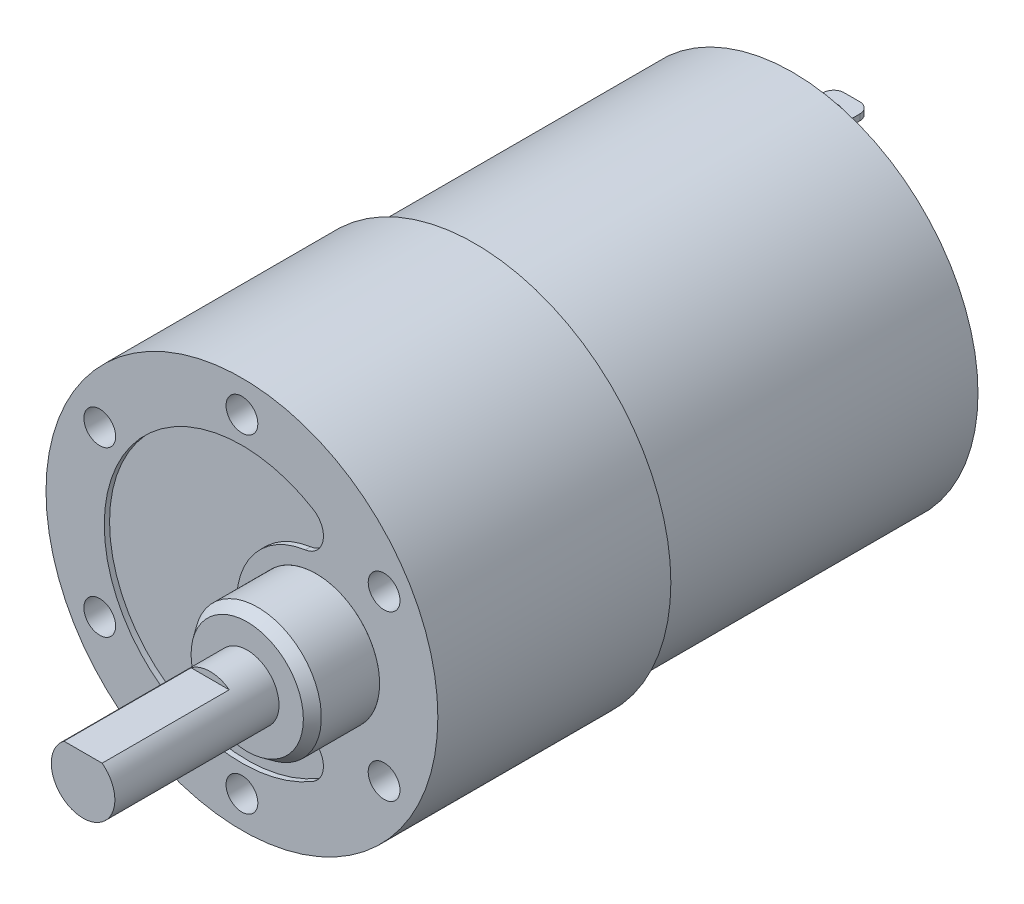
ISO-10303-21;
HEADER;
FILE_DESCRIPTION(('STEP AP214'),'2;1');
FILE_NAME('part.step','',(''),(''),'','','');
FILE_SCHEMA(('AUTOMOTIVE_DESIGN { 1 0 10303 214 1 1 1 1 }'));
ENDSEC;
DATA;
#1=APPLICATION_CONTEXT('core data for automotive mechanical design processes');
#2=APPLICATION_PROTOCOL_DEFINITION('international standard','automotive_design',2000,#1);
#3=PRODUCT_CONTEXT('',#1,'mechanical');
#4=PRODUCT('Part','Part','',(#3));
#5=PRODUCT_RELATED_PRODUCT_CATEGORY('part','',(#4));
#6=PRODUCT_DEFINITION_FORMATION('','',#4);
#7=PRODUCT_DEFINITION_CONTEXT('part definition',#1,'design');
#8=PRODUCT_DEFINITION('design','',#6,#7);
#9=PRODUCT_DEFINITION_SHAPE('','',#8);
#10=(LENGTH_UNIT() NAMED_UNIT(*) SI_UNIT(.MILLI.,.METRE.));
#11=(NAMED_UNIT(*) PLANE_ANGLE_UNIT() SI_UNIT($,.RADIAN.));
#12=(NAMED_UNIT(*) SI_UNIT($,.STERADIAN.) SOLID_ANGLE_UNIT());
#13=UNCERTAINTY_MEASURE_WITH_UNIT(LENGTH_MEASURE(1.E-05),#10,'distance_accuracy_value','');
#14=(GEOMETRIC_REPRESENTATION_CONTEXT(3) GLOBAL_UNCERTAINTY_ASSIGNED_CONTEXT((#13)) GLOBAL_UNIT_ASSIGNED_CONTEXT((#10,
#11,#12)) REPRESENTATION_CONTEXT('',''));
#15=CARTESIAN_POINT('',(0.,0.,0.));
#16=DIRECTION('',(0.,0.,1.));
#17=DIRECTION('',(1.,0.,0.));
#18=AXIS2_PLACEMENT_3D('',#15,#16,#17);
#19=CARTESIAN_POINT('',(0.,0.,0.));
#20=DIRECTION('',(0.,0.,1.));
#21=DIRECTION('',(1.,0.,0.));
#22=AXIS2_PLACEMENT_3D('',#19,#20,#21);
#23=PLANE('',#22);
#24=CARTESIAN_POINT('',(5.69642857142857,-9.41013823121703,0.));
#25=DIRECTION('',(0.,0.,1.));
#26=DIRECTION('',(-1.,0.,0.));
#27=AXIS2_PLACEMENT_3D('',#24,#25,#26);
#28=CIRCLE('',#27,2.);
#29=CARTESIAN_POINT('',(6.73214285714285,-11.1210724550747,0.));
#30=VERTEX_POINT('',#29);
#31=CARTESIAN_POINT('',(5.97086466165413,-7.42905649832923,0.));
#32=VERTEX_POINT('',#31);
#33=EDGE_CURVE('E151',#30,#32,#28,.T.);
#34=ORIENTED_EDGE('',*,*,#33,.F.);
#35=CARTESIAN_POINT('',(0.,0.,0.));
#36=DIRECTION('',(0.,0.,1.));
#37=DIRECTION('',(1.,0.,0.));
#38=AXIS2_PLACEMENT_3D('',#35,#36,#37);
#39=CIRCLE('',#38,13.);
#40=CARTESIAN_POINT('',(6.73214285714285,11.1210724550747,0.));
#41=VERTEX_POINT('',#40);
#42=EDGE_CURVE('E184',#41,#30,#39,.T.);
#43=ORIENTED_EDGE('',*,*,#42,.F.);
#44=CARTESIAN_POINT('',(5.69642857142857,9.41013823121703,0.));
#45=DIRECTION('',(0.,0.,1.));
#46=DIRECTION('',(1.,0.,0.));
#47=AXIS2_PLACEMENT_3D('',#44,#45,#46);
#48=CIRCLE('',#47,2.);
#49=CARTESIAN_POINT('',(5.97086466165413,7.42905649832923,0.));
#50=VERTEX_POINT('',#49);
#51=EDGE_CURVE('E180',#50,#41,#48,.T.);
#52=ORIENTED_EDGE('',*,*,#51,.F.);
#53=CARTESIAN_POINT('',(7.,0.,0.));
#54=DIRECTION('',(0.,0.,-1.));
#55=DIRECTION('',(1.,0.,0.));
#56=AXIS2_PLACEMENT_3D('',#53,#54,#55);
#57=CIRCLE('',#56,7.5);
#58=EDGE_CURVE('E160',#32,#50,#57,.T.);
#59=ORIENTED_EDGE('',*,*,#58,.F.);
#60=EDGE_LOOP('',(#34,#43,#52,#59));
#61=FACE_BOUND('',#60,.T.);
#62=CARTESIAN_POINT('',(0.,0.,0.));
#63=DIRECTION('',(0.,0.,1.));
#64=DIRECTION('',(1.,0.,0.));
#65=AXIS2_PLACEMENT_3D('',#62,#63,#64);
#66=CIRCLE('',#65,18.5);
#67=CARTESIAN_POINT('',(18.5,0.,0.));
#68=VERTEX_POINT('',#67);
#69=EDGE_CURVE('E238',#68,#68,#66,.T.);
#70=ORIENTED_EDGE('',*,*,#69,.T.);
#71=EDGE_LOOP('',(#70));
#72=FACE_BOUND('',#71,.T.);
#73=CARTESIAN_POINT('',(0.,15.5,0.));
#74=DIRECTION('',(0.,0.,1.));
#75=DIRECTION('',(1.,0.,0.));
#76=AXIS2_PLACEMENT_3D('',#73,#74,#75);
#77=CIRCLE('',#76,1.5);
#78=CARTESIAN_POINT('',(1.5,15.5,0.));
#79=VERTEX_POINT('',#78);
#80=EDGE_CURVE('E222',#79,#79,#77,.T.);
#81=ORIENTED_EDGE('',*,*,#80,.F.);
#82=EDGE_LOOP('',(#81));
#83=FACE_BOUND('',#82,.T.);
#84=CARTESIAN_POINT('',(-13.4233937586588,7.74999999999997,0.));
#85=DIRECTION('',(0.,0.,1.));
#86=DIRECTION('',(0.499999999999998,0.86602540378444,0.));
#87=AXIS2_PLACEMENT_3D('',#84,#85,#86);
#88=CIRCLE('',#87,1.5);
#89=CARTESIAN_POINT('',(-12.6733937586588,9.04903810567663,0.));
#90=VERTEX_POINT('',#89);
#91=EDGE_CURVE('E216',#90,#90,#88,.T.);
#92=ORIENTED_EDGE('',*,*,#91,.F.);
#93=EDGE_LOOP('',(#92));
#94=FACE_BOUND('',#93,.T.);
#95=CARTESIAN_POINT('',(-13.4233937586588,-7.75000000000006,0.));
#96=DIRECTION('',(0.,0.,1.));
#97=DIRECTION('',(-0.500000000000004,0.866025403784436,0.));
#98=AXIS2_PLACEMENT_3D('',#95,#96,#97);
#99=CIRCLE('',#98,1.5);
#100=CARTESIAN_POINT('',(-14.1733937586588,-6.45096189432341,0.));
#101=VERTEX_POINT('',#100);
#102=EDGE_CURVE('E210',#101,#101,#99,.T.);
#103=ORIENTED_EDGE('',*,*,#102,.F.);
#104=EDGE_LOOP('',(#103));
#105=FACE_BOUND('',#104,.T.);
#106=CARTESIAN_POINT('',(0.,-15.5,0.));
#107=DIRECTION('',(0.,0.,1.));
#108=DIRECTION('',(-1.,0.,0.));
#109=AXIS2_PLACEMENT_3D('',#106,#107,#108);
#110=CIRCLE('',#109,1.5);
#111=CARTESIAN_POINT('',(-1.5,-15.5,0.));
#112=VERTEX_POINT('',#111);
#113=EDGE_CURVE('E204',#112,#112,#110,.T.);
#114=ORIENTED_EDGE('',*,*,#113,.F.);
#115=EDGE_LOOP('',(#114));
#116=FACE_BOUND('',#115,.T.);
#117=CARTESIAN_POINT('',(13.4233937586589,-7.74999999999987,0.));
#118=DIRECTION('',(0.,0.,1.));
#119=DIRECTION('',(-0.499999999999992,-0.866025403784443,0.));
#120=AXIS2_PLACEMENT_3D('',#117,#118,#119);
#121=CIRCLE('',#120,1.5);
#122=CARTESIAN_POINT('',(12.6733937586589,-9.04903810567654,0.));
#123=VERTEX_POINT('',#122);
#124=EDGE_CURVE('E198',#123,#123,#121,.T.);
#125=ORIENTED_EDGE('',*,*,#124,.F.);
#126=EDGE_LOOP('',(#125));
#127=FACE_BOUND('',#126,.T.);
#128=CARTESIAN_POINT('',(13.4233937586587,7.75000000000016,0.));
#129=DIRECTION('',(0.,0.,1.));
#130=DIRECTION('',(0.50000000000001,-0.866025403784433,0.));
#131=AXIS2_PLACEMENT_3D('',#128,#129,#130);
#132=CIRCLE('',#131,1.5);
#133=CARTESIAN_POINT('',(14.1733937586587,6.45096189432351,0.));
#134=VERTEX_POINT('',#133);
#135=EDGE_CURVE('E192',#134,#134,#132,.T.);
#136=ORIENTED_EDGE('',*,*,#135,.F.);
#137=EDGE_LOOP('',(#136));
#138=FACE_BOUND('',#137,.T.);
#139=CARTESIAN_POINT('',(7.,0.,0.));
#140=DIRECTION('',(0.,0.,1.));
#141=DIRECTION('',(1.,0.,0.));
#142=AXIS2_PLACEMENT_3D('',#139,#140,#141);
#143=CIRCLE('',#142,6.);
#144=CARTESIAN_POINT('',(13.,0.,0.));
#145=VERTEX_POINT('',#144);
#146=EDGE_CURVE('E46',#145,#145,#143,.T.);
#147=ORIENTED_EDGE('',*,*,#146,.F.);
#148=EDGE_LOOP('',(#147));
#149=FACE_BOUND('',#148,.T.);
#150=ADVANCED_FACE('F42',(#61,#72,#83,#94,#105,#116,#127,#138,#149),#23,.T.);
#151=CARTESIAN_POINT('',(1.73676249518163,-12.0859636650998,-57.6));
#152=DIRECTION('',(0.,1.,0.));
#153=DIRECTION('',(0.,0.,1.));
#154=AXIS2_PLACEMENT_3D('',#151,#152,#153);
#155=PLANE('',#154);
#156=DIRECTION('',(-1.,0.,0.));
#157=VECTOR('',#156,1.);
#158=CARTESIAN_POINT('',(1.73676249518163,-12.0859636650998,-57.6));
#159=LINE('',#158,#157);
#160=CARTESIAN_POINT('',(0.736762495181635,-12.0859636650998,-57.6));
#161=VERTEX_POINT('',#160);
#162=CARTESIAN_POINT('',(-0.736762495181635,-12.0859636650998,-57.6));
#163=VERTEX_POINT('',#162);
#164=EDGE_CURVE('E234',#161,#163,#159,.T.);
#165=ORIENTED_EDGE('',*,*,#164,.T.);
#166=CARTESIAN_POINT('',(-0.736762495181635,-12.0859636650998,-56.6));
#167=DIRECTION('',(0.,1.,0.));
#168=DIRECTION('',(0.,0.,1.));
#169=AXIS2_PLACEMENT_3D('',#166,#167,#168);
#170=CIRCLE('',#169,1.);
#171=CARTESIAN_POINT('',(-1.73676249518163,-12.0859636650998,-56.6));
#172=VERTEX_POINT('',#171);
#173=EDGE_CURVE('E237',#163,#172,#170,.T.);
#174=ORIENTED_EDGE('',*,*,#173,.T.);
#175=DIRECTION('',(0.,0.,1.));
#176=VECTOR('',#175,1.);
#177=CARTESIAN_POINT('',(-1.73676249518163,-12.0859636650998,-57.6));
#178=LINE('',#177,#176);
#179=CARTESIAN_POINT('',(-1.73676249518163,-12.0859636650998,-52.));
#180=VERTEX_POINT('',#179);
#181=EDGE_CURVE('E264',#172,#180,#178,.T.);
#182=ORIENTED_EDGE('',*,*,#181,.T.);
#183=DIRECTION('',(-1.,0.,0.));
#184=VECTOR('',#183,1.);
#185=CARTESIAN_POINT('',(1.73676249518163,-12.0859636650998,-52.));
#186=LINE('',#185,#184);
#187=CARTESIAN_POINT('',(1.73676249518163,-12.0859636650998,-52.));
#188=VERTEX_POINT('',#187);
#189=EDGE_CURVE('E247',#188,#180,#186,.T.);
#190=ORIENTED_EDGE('',*,*,#189,.F.);
#191=DIRECTION('',(0.,0.,1.));
#192=VECTOR('',#191,1.);
#193=CARTESIAN_POINT('',(1.73676249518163,-12.0859636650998,-57.6));
#194=LINE('',#193,#192);
#195=CARTESIAN_POINT('',(1.73676249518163,-12.0859636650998,-56.6));
#196=VERTEX_POINT('',#195);
#197=EDGE_CURVE('E261',#196,#188,#194,.T.);
#198=ORIENTED_EDGE('',*,*,#197,.F.);
#199=CARTESIAN_POINT('',(0.736762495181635,-12.0859636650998,-56.6));
#200=DIRECTION('',(0.,1.,0.));
#201=DIRECTION('',(0.,0.,1.));
#202=AXIS2_PLACEMENT_3D('',#199,#200,#201);
#203=CIRCLE('',#202,1.);
#204=EDGE_CURVE('E266',#196,#161,#203,.T.);
#205=ORIENTED_EDGE('',*,*,#204,.T.);
#206=EDGE_LOOP('',(#165,#174,#182,#190,#198,#205));
#207=FACE_BOUND('',#206,.T.);
#208=CARTESIAN_POINT('',(0.,-12.0859636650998,-55.7146202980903));
#209=DIRECTION('',(0.,1.,0.));
#210=DIRECTION('',(0.,0.,1.));
#211=AXIS2_PLACEMENT_3D('',#208,#209,#210);
#212=CIRCLE('',#211,0.618667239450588);
#213=CARTESIAN_POINT('',(0.,-12.0859636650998,-55.0959530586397));
#214=VERTEX_POINT('',#213);
#215=EDGE_CURVE('E225',#214,#214,#212,.T.);
#216=ORIENTED_EDGE('',*,*,#215,.F.);
#217=EDGE_LOOP('',(#216));
#218=FACE_BOUND('',#217,.T.);
#219=ADVANCED_FACE('F352',(#207,#218),#155,.T.);
#220=CARTESIAN_POINT('',(1.73676249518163,-12.6569540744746,-57.6));
#221=DIRECTION('',(0.,-1.,0.));
#222=DIRECTION('',(0.,0.,-1.));
#223=AXIS2_PLACEMENT_3D('',#220,#221,#222);
#224=PLANE('',#223);
#225=DIRECTION('',(0.,0.,1.));
#226=VECTOR('',#225,1.);
#227=CARTESIAN_POINT('',(-1.73676249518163,-12.6569540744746,-57.6));
#228=LINE('',#227,#226);
#229=CARTESIAN_POINT('',(-1.73676249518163,-12.6569540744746,-56.6));
#230=VERTEX_POINT('',#229);
#231=CARTESIAN_POINT('',(-1.73676249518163,-12.6569540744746,-52.));
#232=VERTEX_POINT('',#231);
#233=EDGE_CURVE('E256',#230,#232,#228,.T.);
#234=ORIENTED_EDGE('',*,*,#233,.F.);
#235=CARTESIAN_POINT('',(-0.736762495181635,-12.6569540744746,-56.6));
#236=DIRECTION('',(0.,-1.,0.));
#237=DIRECTION('',(0.,0.,-1.));
#238=AXIS2_PLACEMENT_3D('',#235,#236,#237);
#239=CIRCLE('',#238,1.);
#240=CARTESIAN_POINT('',(-0.736762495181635,-12.6569540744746,-57.6));
#241=VERTEX_POINT('',#240);
#242=EDGE_CURVE('E243',#230,#241,#239,.T.);
#243=ORIENTED_EDGE('',*,*,#242,.T.);
#244=DIRECTION('',(1.,0.,0.));
#245=VECTOR('',#244,1.);
#246=CARTESIAN_POINT('',(1.73676249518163,-12.6569540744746,-57.6));
#247=LINE('',#246,#245);
#248=CARTESIAN_POINT('',(0.736762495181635,-12.6569540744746,-57.6));
#249=VERTEX_POINT('',#248);
#250=EDGE_CURVE('E239',#241,#249,#247,.T.);
#251=ORIENTED_EDGE('',*,*,#250,.T.);
#252=CARTESIAN_POINT('',(0.736762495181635,-12.6569540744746,-56.6));
#253=DIRECTION('',(0.,-1.,0.));
#254=DIRECTION('',(0.,0.,-1.));
#255=AXIS2_PLACEMENT_3D('',#252,#253,#254);
#256=CIRCLE('',#255,1.);
#257=CARTESIAN_POINT('',(1.73676249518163,-12.6569540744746,-56.6));
#258=VERTEX_POINT('',#257);
#259=EDGE_CURVE('E242',#249,#258,#256,.T.);
#260=ORIENTED_EDGE('',*,*,#259,.T.);
#261=DIRECTION('',(0.,0.,1.));
#262=VECTOR('',#261,1.);
#263=CARTESIAN_POINT('',(1.73676249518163,-12.6569540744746,-57.6));
#264=LINE('',#263,#262);
#265=CARTESIAN_POINT('',(1.73676249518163,-12.6569540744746,-52.));
#266=VERTEX_POINT('',#265);
#267=EDGE_CURVE('E230',#258,#266,#264,.T.);
#268=ORIENTED_EDGE('',*,*,#267,.T.);
#269=DIRECTION('',(1.,0.,0.));
#270=VECTOR('',#269,1.);
#271=CARTESIAN_POINT('',(1.73676249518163,-12.6569540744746,-52.));
#272=LINE('',#271,#270);
#273=EDGE_CURVE('E246',#232,#266,#272,.T.);
#274=ORIENTED_EDGE('',*,*,#273,.F.);
#275=EDGE_LOOP('',(#234,#243,#251,#260,#268,#274));
#276=FACE_BOUND('',#275,.T.);
#277=CARTESIAN_POINT('',(0.,-12.6569540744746,-55.7146202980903));
#278=DIRECTION('',(0.,1.,0.));
#279=DIRECTION('',(0.,0.,1.));
#280=AXIS2_PLACEMENT_3D('',#277,#278,#279);
#281=CIRCLE('',#280,0.618667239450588);
#282=CARTESIAN_POINT('',(0.,-12.6569540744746,-55.0959530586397));
#283=VERTEX_POINT('',#282);
#284=EDGE_CURVE('E226',#283,#283,#281,.T.);
#285=ORIENTED_EDGE('',*,*,#284,.T.);
#286=EDGE_LOOP('',(#285));
#287=FACE_BOUND('',#286,.T.);
#288=ADVANCED_FACE('F366',(#276,#287),#224,.T.);
#289=CARTESIAN_POINT('',(0.,0.,-52.));
#290=DIRECTION('',(0.,0.,-1.));
#291=DIRECTION('',(-1.,0.,0.));
#292=AXIS2_PLACEMENT_3D('',#289,#290,#291);
#293=PLANE('',#292);
#294=DIRECTION('',(0.,-1.,0.));
#295=VECTOR('',#294,1.);
#296=CARTESIAN_POINT('',(-1.73676249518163,-12.6569540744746,-52.));
#297=LINE('',#296,#295);
#298=EDGE_CURVE('E229',#180,#232,#297,.T.);
#299=ORIENTED_EDGE('',*,*,#298,.T.);
#300=ORIENTED_EDGE('',*,*,#273,.T.);
#301=DIRECTION('',(0.,1.,0.));
#302=VECTOR('',#301,1.);
#303=CARTESIAN_POINT('',(1.73676249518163,-12.6569540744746,-52.));
#304=LINE('',#303,#302);
#305=EDGE_CURVE('E251',#266,#188,#304,.T.);
#306=ORIENTED_EDGE('',*,*,#305,.T.);
#307=ORIENTED_EDGE('',*,*,#189,.T.);
#308=EDGE_LOOP('',(#299,#300,#306,#307));
#309=FACE_BOUND('',#308,.T.);
#310=CARTESIAN_POINT('',(0.,0.,-52.));
#311=DIRECTION('',(0.,0.,-1.));
#312=DIRECTION('',(-1.,0.,0.));
#313=AXIS2_PLACEMENT_3D('',#310,#311,#312);
#314=CIRCLE('',#313,4.5);
#315=CARTESIAN_POINT('',(-4.5,0.,-52.));
#316=VERTEX_POINT('',#315);
#317=EDGE_CURVE('E307',#316,#316,#314,.T.);
#318=ORIENTED_EDGE('',*,*,#317,.F.);
#319=EDGE_LOOP('',(#318));
#320=FACE_BOUND('',#319,.T.);
#321=CARTESIAN_POINT('',(0.,0.,-52.));
#322=DIRECTION('',(0.,0.,-1.));
#323=DIRECTION('',(-1.,0.,0.));
#324=AXIS2_PLACEMENT_3D('',#321,#322,#323);
#325=CIRCLE('',#324,17.5);
#326=CARTESIAN_POINT('',(-17.5,0.,-52.));
#327=VERTEX_POINT('',#326);
#328=EDGE_CURVE('E250',#327,#327,#325,.T.);
#329=ORIENTED_EDGE('',*,*,#328,.T.);
#330=EDGE_LOOP('',(#329));
#331=FACE_BOUND('',#330,.T.);
#332=DIRECTION('',(1.,0.,0.));
#333=VECTOR('',#332,1.);
#334=CARTESIAN_POINT('',(1.73676249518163,12.6569540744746,-52.));
#335=LINE('',#334,#333);
#336=CARTESIAN_POINT('',(-1.73676249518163,12.6569540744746,-52.));
#337=VERTEX_POINT('',#336);
#338=CARTESIAN_POINT('',(1.73676249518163,12.6569540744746,-52.));
#339=VERTEX_POINT('',#338);
#340=EDGE_CURVE('E287',#337,#339,#335,.T.);
#341=ORIENTED_EDGE('',*,*,#340,.F.);
#342=DIRECTION('',(0.,1.,0.));
#343=VECTOR('',#342,1.);
#344=CARTESIAN_POINT('',(-1.73676249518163,12.6569540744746,-52.));
#345=LINE('',#344,#343);
#346=CARTESIAN_POINT('',(-1.73676249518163,12.0859636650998,-52.));
#347=VERTEX_POINT('',#346);
#348=EDGE_CURVE('E282',#347,#337,#345,.T.);
#349=ORIENTED_EDGE('',*,*,#348,.F.);
#350=DIRECTION('',(-1.,0.,0.));
#351=VECTOR('',#350,1.);
#352=CARTESIAN_POINT('',(1.73676249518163,12.0859636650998,-52.));
#353=LINE('',#352,#351);
#354=CARTESIAN_POINT('',(1.73676249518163,12.0859636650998,-52.));
#355=VERTEX_POINT('',#354);
#356=EDGE_CURVE('E281',#355,#347,#353,.T.);
#357=ORIENTED_EDGE('',*,*,#356,.F.);
#358=DIRECTION('',(0.,-1.,0.));
#359=VECTOR('',#358,1.);
#360=CARTESIAN_POINT('',(1.73676249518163,12.6569540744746,-52.));
#361=LINE('',#360,#359);
#362=EDGE_CURVE('E292',#339,#355,#361,.T.);
#363=ORIENTED_EDGE('',*,*,#362,.F.);
#364=EDGE_LOOP('',(#341,#349,#357,#363));
#365=FACE_BOUND('',#364,.T.);
#366=ADVANCED_FACE('F358',(#309,#320,#331,#365),#293,.T.);
#367=CARTESIAN_POINT('',(0.,0.,-22.));
#368=DIRECTION('',(0.,0.,1.));
#369=DIRECTION('',(1.,0.,0.));
#370=AXIS2_PLACEMENT_3D('',#367,#368,#369);
#371=PLANE('',#370);
#372=CARTESIAN_POINT('',(0.,0.,-22.));
#373=DIRECTION('',(0.,0.,1.));
#374=DIRECTION('',(1.,0.,0.));
#375=AXIS2_PLACEMENT_3D('',#372,#373,#374);
#376=CIRCLE('',#375,18.5);
#377=CARTESIAN_POINT('',(18.5,0.,-22.));
#378=VERTEX_POINT('',#377);
#379=EDGE_CURVE('E313',#378,#378,#376,.T.);
#380=ORIENTED_EDGE('',*,*,#379,.F.);
#381=EDGE_LOOP('',(#380));
#382=FACE_BOUND('',#381,.T.);
#383=CARTESIAN_POINT('',(0.,0.,-22.));
#384=DIRECTION('',(0.,0.,1.));
#385=DIRECTION('',(1.,0.,0.));
#386=AXIS2_PLACEMENT_3D('',#383,#384,#385);
#387=CIRCLE('',#386,17.5);
#388=CARTESIAN_POINT('',(17.5,0.,-22.));
#389=VERTEX_POINT('',#388);
#390=EDGE_CURVE('E316',#389,#389,#387,.F.);
#391=ORIENTED_EDGE('',*,*,#390,.F.);
#392=EDGE_LOOP('',(#391));
#393=FACE_BOUND('',#392,.T.);
#394=ADVANCED_FACE('F399',(#382,#393),#371,.F.);
#395=CARTESIAN_POINT('',(0.,0.,-22.));
#396=DIRECTION('',(0.,0.,1.));
#397=DIRECTION('',(1.,0.,0.));
#398=AXIS2_PLACEMENT_3D('',#395,#396,#397);
#399=CYLINDRICAL_SURFACE('',#398,18.5);
#400=ORIENTED_EDGE('',*,*,#379,.T.);
#401=EDGE_LOOP('',(#400));
#402=FACE_BOUND('',#401,.T.);
#403=ORIENTED_EDGE('',*,*,#69,.F.);
#404=EDGE_LOOP('',(#403));
#405=FACE_BOUND('',#404,.T.);
#406=ADVANCED_FACE('F397',(#402,#405),#399,.T.);
#407=CARTESIAN_POINT('',(0.,0.,-52.));
#408=DIRECTION('',(0.,0.,1.));
#409=DIRECTION('',(1.,0.,0.));
#410=AXIS2_PLACEMENT_3D('',#407,#408,#409);
#411=CYLINDRICAL_SURFACE('',#410,17.5);
#412=ORIENTED_EDGE('',*,*,#328,.F.);
#413=EDGE_LOOP('',(#412));
#414=FACE_BOUND('',#413,.T.);
#415=ORIENTED_EDGE('',*,*,#390,.T.);
#416=EDGE_LOOP('',(#415));
#417=FACE_BOUND('',#416,.T.);
#418=ADVANCED_FACE('F403',(#414,#417),#411,.T.);
#419=CARTESIAN_POINT('',(0.,0.,-53.));
#420=DIRECTION('',(0.,0.,-1.));
#421=DIRECTION('',(-1.,0.,0.));
#422=AXIS2_PLACEMENT_3D('',#419,#420,#421);
#423=PLANE('',#422);
#424=CARTESIAN_POINT('',(0.,0.,-53.));
#425=DIRECTION('',(0.,0.,-1.));
#426=DIRECTION('',(-1.,0.,0.));
#427=AXIS2_PLACEMENT_3D('',#424,#425,#426);
#428=CIRCLE('',#427,3.5);
#429=CARTESIAN_POINT('',(-3.5,0.,-53.));
#430=VERTEX_POINT('',#429);
#431=EDGE_CURVE('E310',#430,#430,#428,.T.);
#432=ORIENTED_EDGE('',*,*,#431,.T.);
#433=EDGE_LOOP('',(#432));
#434=FACE_BOUND('',#433,.T.);
#435=ADVANCED_FACE('F406',(#434),#423,.T.);
#436=CARTESIAN_POINT('',(0.,0.,-52.));
#437=DIRECTION('',(0.,0.,-1.));
#438=DIRECTION('',(-1.,0.,0.));
#439=AXIS2_PLACEMENT_3D('',#436,#437,#438);
#440=TOROIDAL_SURFACE('',#439,3.5,1.);
#441=ORIENTED_EDGE('',*,*,#317,.T.);
#442=EDGE_LOOP('',(#441));
#443=FACE_BOUND('',#442,.T.);
#444=ORIENTED_EDGE('',*,*,#431,.F.);
#445=EDGE_LOOP('',(#444));
#446=FACE_BOUND('',#445,.T.);
#447=ADVANCED_FACE('F412',(#443,#446),#440,.T.);
#448=CARTESIAN_POINT('',(-1.73676249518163,12.6569540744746,-57.6));
#449=DIRECTION('',(1.,0.,0.));
#450=DIRECTION('',(0.,0.,-1.));
#451=AXIS2_PLACEMENT_3D('',#448,#449,#450);
#452=PLANE('',#451);
#453=DIRECTION('',(0.,0.,1.));
#454=VECTOR('',#453,1.);
#455=CARTESIAN_POINT('',(-1.73676249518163,12.6569540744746,-57.6));
#456=LINE('',#455,#454);
#457=CARTESIAN_POINT('',(-1.73676249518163,12.6569540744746,-56.6));
#458=VERTEX_POINT('',#457);
#459=EDGE_CURVE('E291',#458,#337,#456,.T.);
#460=ORIENTED_EDGE('',*,*,#459,.F.);
#461=DIRECTION('',(0.,1.,0.));
#462=VECTOR('',#461,1.);
#463=CARTESIAN_POINT('',(-1.73676249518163,12.0859636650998,-56.6));
#464=LINE('',#463,#462);
#465=CARTESIAN_POINT('',(-1.73676249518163,12.0859636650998,-56.6));
#466=VERTEX_POINT('',#465);
#467=EDGE_CURVE('E301',#458,#466,#464,.F.);
#468=ORIENTED_EDGE('',*,*,#467,.T.);
#469=DIRECTION('',(0.,0.,1.));
#470=VECTOR('',#469,1.);
#471=CARTESIAN_POINT('',(-1.73676249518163,12.0859636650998,-57.6));
#472=LINE('',#471,#470);
#473=EDGE_CURVE('E286',#466,#347,#472,.T.);
#474=ORIENTED_EDGE('',*,*,#473,.T.);
#475=ORIENTED_EDGE('',*,*,#348,.T.);
#476=EDGE_LOOP('',(#460,#468,#474,#475));
#477=FACE_BOUND('',#476,.T.);
#478=ADVANCED_FACE('F414',(#477),#452,.F.);
#479=CARTESIAN_POINT('',(1.73676249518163,12.6569540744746,-57.6));
#480=DIRECTION('',(0.,-1.,0.));
#481=DIRECTION('',(0.,0.,-1.));
#482=AXIS2_PLACEMENT_3D('',#479,#480,#481);
#483=PLANE('',#482);
#484=CARTESIAN_POINT('',(0.,12.6569540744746,-55.7146202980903));
#485=DIRECTION('',(0.,1.,0.));
#486=DIRECTION('',(0.,0.,1.));
#487=AXIS2_PLACEMENT_3D('',#484,#485,#486);
#488=CIRCLE('',#487,0.618667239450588);
#489=CARTESIAN_POINT('',(0.,12.6569540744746,-55.0959530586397));
#490=VERTEX_POINT('',#489);
#491=EDGE_CURVE('E267',#490,#490,#488,.T.);
#492=ORIENTED_EDGE('',*,*,#491,.F.);
#493=EDGE_LOOP('',(#492));
#494=FACE_BOUND('',#493,.T.);
#495=DIRECTION('',(1.,0.,0.));
#496=VECTOR('',#495,1.);
#497=CARTESIAN_POINT('',(1.73676249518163,12.6569540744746,-57.6));
#498=LINE('',#497,#496);
#499=CARTESIAN_POINT('',(-0.736762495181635,12.6569540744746,-57.6));
#500=VERTEX_POINT('',#499);
#501=CARTESIAN_POINT('',(0.736762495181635,12.6569540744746,-57.6));
#502=VERTEX_POINT('',#501);
#503=EDGE_CURVE('E274',#500,#502,#498,.T.);
#504=ORIENTED_EDGE('',*,*,#503,.F.);
#505=CARTESIAN_POINT('',(-0.736762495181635,12.6569540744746,-56.6));
#506=DIRECTION('',(0.,-1.,0.));
#507=DIRECTION('',(0.,0.,-1.));
#508=AXIS2_PLACEMENT_3D('',#505,#506,#507);
#509=CIRCLE('',#508,1.);
#510=EDGE_CURVE('E285',#500,#458,#509,.F.);
#511=ORIENTED_EDGE('',*,*,#510,.T.);
#512=ORIENTED_EDGE('',*,*,#459,.T.);
#513=ORIENTED_EDGE('',*,*,#340,.T.);
#514=DIRECTION('',(0.,0.,1.));
#515=VECTOR('',#514,1.);
#516=CARTESIAN_POINT('',(1.73676249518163,12.6569540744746,-57.6));
#517=LINE('',#516,#515);
#518=CARTESIAN_POINT('',(1.73676249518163,12.6569540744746,-56.6));
#519=VERTEX_POINT('',#518);
#520=EDGE_CURVE('E296',#519,#339,#517,.T.);
#521=ORIENTED_EDGE('',*,*,#520,.F.);
#522=CARTESIAN_POINT('',(0.736762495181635,12.6569540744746,-56.6));
#523=DIRECTION('',(0.,-1.,0.));
#524=DIRECTION('',(0.,0.,-1.));
#525=AXIS2_PLACEMENT_3D('',#522,#523,#524);
#526=CIRCLE('',#525,1.);
#527=EDGE_CURVE('E290',#519,#502,#526,.F.);
#528=ORIENTED_EDGE('',*,*,#527,.T.);
#529=EDGE_LOOP('',(#504,#511,#512,#513,#521,#528));
#530=FACE_BOUND('',#529,.T.);
#531=ADVANCED_FACE('F417',(#494,#530),#483,.F.);
#532=CARTESIAN_POINT('',(1.73676249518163,12.6569540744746,-57.6));
#533=DIRECTION('',(-1.,0.,0.));
#534=DIRECTION('',(0.,0.,1.));
#535=AXIS2_PLACEMENT_3D('',#532,#533,#534);
#536=PLANE('',#535);
#537=DIRECTION('',(0.,0.,1.));
#538=VECTOR('',#537,1.);
#539=CARTESIAN_POINT('',(1.73676249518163,12.0859636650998,-57.6));
#540=LINE('',#539,#538);
#541=CARTESIAN_POINT('',(1.73676249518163,12.0859636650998,-56.6));
#542=VERTEX_POINT('',#541);
#543=EDGE_CURVE('E299',#542,#355,#540,.T.);
#544=ORIENTED_EDGE('',*,*,#543,.F.);
#545=DIRECTION('',(0.,-1.,0.));
#546=VECTOR('',#545,1.);
#547=CARTESIAN_POINT('',(1.73676249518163,12.6569540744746,-56.6));
#548=LINE('',#547,#546);
#549=EDGE_CURVE('E305',#542,#519,#548,.F.);
#550=ORIENTED_EDGE('',*,*,#549,.T.);
#551=ORIENTED_EDGE('',*,*,#520,.T.);
#552=ORIENTED_EDGE('',*,*,#362,.T.);
#553=EDGE_LOOP('',(#544,#550,#551,#552));
#554=FACE_BOUND('',#553,.T.);
#555=ADVANCED_FACE('F421',(#554),#536,.F.);
#556=CARTESIAN_POINT('',(1.73676249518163,12.0859636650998,-57.6));
#557=DIRECTION('',(0.,1.,0.));
#558=DIRECTION('',(0.,0.,1.));
#559=AXIS2_PLACEMENT_3D('',#556,#557,#558);
#560=PLANE('',#559);
#561=CARTESIAN_POINT('',(0.,12.0859636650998,-55.7146202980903));
#562=DIRECTION('',(0.,1.,0.));
#563=DIRECTION('',(0.,0.,1.));
#564=AXIS2_PLACEMENT_3D('',#561,#562,#563);
#565=CIRCLE('',#564,0.618667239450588);
#566=CARTESIAN_POINT('',(0.,12.0859636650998,-55.0959530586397));
#567=VERTEX_POINT('',#566);
#568=EDGE_CURVE('E270',#567,#567,#565,.F.);
#569=ORIENTED_EDGE('',*,*,#568,.F.);
#570=EDGE_LOOP('',(#569));
#571=FACE_BOUND('',#570,.T.);
#572=ORIENTED_EDGE('',*,*,#473,.F.);
#573=CARTESIAN_POINT('',(-0.736762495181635,12.0859636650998,-56.6));
#574=DIRECTION('',(0.,1.,0.));
#575=DIRECTION('',(0.,0.,1.));
#576=AXIS2_PLACEMENT_3D('',#573,#574,#575);
#577=CIRCLE('',#576,1.);
#578=CARTESIAN_POINT('',(-0.736762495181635,12.0859636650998,-57.6));
#579=VERTEX_POINT('',#578);
#580=EDGE_CURVE('E295',#466,#579,#577,.F.);
#581=ORIENTED_EDGE('',*,*,#580,.T.);
#582=DIRECTION('',(-1.,0.,0.));
#583=VECTOR('',#582,1.);
#584=CARTESIAN_POINT('',(1.73676249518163,12.0859636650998,-57.6));
#585=LINE('',#584,#583);
#586=CARTESIAN_POINT('',(0.736762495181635,12.0859636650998,-57.6));
#587=VERTEX_POINT('',#586);
#588=EDGE_CURVE('E278',#587,#579,#585,.T.);
#589=ORIENTED_EDGE('',*,*,#588,.F.);
#590=CARTESIAN_POINT('',(0.736762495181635,12.0859636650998,-56.6));
#591=DIRECTION('',(0.,1.,0.));
#592=DIRECTION('',(0.,0.,1.));
#593=AXIS2_PLACEMENT_3D('',#590,#591,#592);
#594=CIRCLE('',#593,1.);
#595=EDGE_CURVE('E303',#587,#542,#594,.F.);
#596=ORIENTED_EDGE('',*,*,#595,.T.);
#597=ORIENTED_EDGE('',*,*,#543,.T.);
#598=ORIENTED_EDGE('',*,*,#356,.T.);
#599=EDGE_LOOP('',(#572,#581,#589,#596,#597,#598));
#600=FACE_BOUND('',#599,.T.);
#601=ADVANCED_FACE('F425',(#571,#600),#560,.F.);
#602=CARTESIAN_POINT('',(0.,0.,-57.6));
#603=DIRECTION('',(0.,0.,-1.));
#604=DIRECTION('',(-1.,0.,0.));
#605=AXIS2_PLACEMENT_3D('',#602,#603,#604);
#606=PLANE('',#605);
#607=ORIENTED_EDGE('',*,*,#588,.T.);
#608=DIRECTION('',(0.,1.,0.));
#609=VECTOR('',#608,1.);
#610=CARTESIAN_POINT('',(-0.736762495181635,12.6569540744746,-57.6));
#611=LINE('',#610,#609);
#612=EDGE_CURVE('E277',#579,#500,#611,.T.);
#613=ORIENTED_EDGE('',*,*,#612,.T.);
#614=ORIENTED_EDGE('',*,*,#503,.T.);
#615=DIRECTION('',(0.,-1.,0.));
#616=VECTOR('',#615,1.);
#617=CARTESIAN_POINT('',(0.736762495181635,12.0859636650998,-57.6));
#618=LINE('',#617,#616);
#619=EDGE_CURVE('E271',#502,#587,#618,.T.);
#620=ORIENTED_EDGE('',*,*,#619,.T.);
#621=EDGE_LOOP('',(#607,#613,#614,#620));
#622=FACE_BOUND('',#621,.T.);
#623=ADVANCED_FACE('F429',(#622),#606,.T.);
#624=CARTESIAN_POINT('',(-0.736762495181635,0.,-56.6));
#625=DIRECTION('',(0.,-1.,0.));
#626=DIRECTION('',(0.,0.,-1.));
#627=AXIS2_PLACEMENT_3D('',#624,#625,#626);
#628=CYLINDRICAL_SURFACE('',#627,1.);
#629=ORIENTED_EDGE('',*,*,#580,.F.);
#630=ORIENTED_EDGE('',*,*,#467,.F.);
#631=ORIENTED_EDGE('',*,*,#510,.F.);
#632=ORIENTED_EDGE('',*,*,#612,.F.);
#633=EDGE_LOOP('',(#629,#630,#631,#632));
#634=FACE_BOUND('',#633,.T.);
#635=ADVANCED_FACE('F433',(#634),#628,.T.);
#636=CARTESIAN_POINT('',(0.736762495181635,0.,-56.6));
#637=DIRECTION('',(0.,1.,0.));
#638=DIRECTION('',(0.,0.,1.));
#639=AXIS2_PLACEMENT_3D('',#636,#637,#638);
#640=CYLINDRICAL_SURFACE('',#639,1.);
#641=ORIENTED_EDGE('',*,*,#527,.F.);
#642=ORIENTED_EDGE('',*,*,#549,.F.);
#643=ORIENTED_EDGE('',*,*,#595,.F.);
#644=ORIENTED_EDGE('',*,*,#619,.F.);
#645=EDGE_LOOP('',(#641,#642,#643,#644));
#646=FACE_BOUND('',#645,.T.);
#647=ADVANCED_FACE('F438',(#646),#640,.T.);
#648=CARTESIAN_POINT('',(0.,-18.501,-55.7146202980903));
#649=DIRECTION('',(0.,1.,0.));
#650=DIRECTION('',(0.,0.,1.));
#651=AXIS2_PLACEMENT_3D('',#648,#649,#650);
#652=CYLINDRICAL_SURFACE('',#651,0.618667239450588);
#653=ORIENTED_EDGE('',*,*,#491,.T.);
#654=EDGE_LOOP('',(#653));
#655=FACE_BOUND('',#654,.T.);
#656=ORIENTED_EDGE('',*,*,#568,.T.);
#657=EDGE_LOOP('',(#656));
#658=FACE_BOUND('',#657,.T.);
#659=ADVANCED_FACE('F435',(#655,#658),#652,.F.);
#660=CARTESIAN_POINT('',(-1.73676249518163,-12.6569540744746,-57.6));
#661=DIRECTION('',(-1.,0.,0.));
#662=DIRECTION('',(0.,0.,1.));
#663=AXIS2_PLACEMENT_3D('',#660,#661,#662);
#664=PLANE('',#663);
#665=ORIENTED_EDGE('',*,*,#181,.F.);
#666=DIRECTION('',(0.,-1.,0.));
#667=VECTOR('',#666,1.);
#668=CARTESIAN_POINT('',(-1.73676249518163,-12.6569540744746,-56.6));
#669=LINE('',#668,#667);
#670=EDGE_CURVE('E259',#172,#230,#669,.T.);
#671=ORIENTED_EDGE('',*,*,#670,.T.);
#672=ORIENTED_EDGE('',*,*,#233,.T.);
#673=ORIENTED_EDGE('',*,*,#298,.F.);
#674=EDGE_LOOP('',(#665,#671,#672,#673));
#675=FACE_BOUND('',#674,.T.);
#676=ADVANCED_FACE('F362',(#675),#664,.T.);
#677=CARTESIAN_POINT('',(1.73676249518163,-12.6569540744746,-57.6));
#678=DIRECTION('',(1.,0.,0.));
#679=DIRECTION('',(0.,0.,-1.));
#680=AXIS2_PLACEMENT_3D('',#677,#678,#679);
#681=PLANE('',#680);
#682=ORIENTED_EDGE('',*,*,#267,.F.);
#683=DIRECTION('',(0.,1.,0.));
#684=VECTOR('',#683,1.);
#685=CARTESIAN_POINT('',(1.73676249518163,-12.6569540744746,-56.6));
#686=LINE('',#685,#684);
#687=EDGE_CURVE('E258',#258,#196,#686,.T.);
#688=ORIENTED_EDGE('',*,*,#687,.T.);
#689=ORIENTED_EDGE('',*,*,#197,.T.);
#690=ORIENTED_EDGE('',*,*,#305,.F.);
#691=EDGE_LOOP('',(#682,#688,#689,#690));
#692=FACE_BOUND('',#691,.T.);
#693=ADVANCED_FACE('F346',(#692),#681,.T.);
#694=CARTESIAN_POINT('',(0.,0.,-57.6));
#695=DIRECTION('',(0.,0.,-1.));
#696=DIRECTION('',(-1.,0.,0.));
#697=AXIS2_PLACEMENT_3D('',#694,#695,#696);
#698=PLANE('',#697);
#699=ORIENTED_EDGE('',*,*,#250,.F.);
#700=DIRECTION('',(0.,-1.,0.));
#701=VECTOR('',#700,1.);
#702=CARTESIAN_POINT('',(-0.736762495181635,0.,-57.6));
#703=LINE('',#702,#701);
#704=EDGE_CURVE('E263',#241,#163,#703,.F.);
#705=ORIENTED_EDGE('',*,*,#704,.T.);
#706=ORIENTED_EDGE('',*,*,#164,.F.);
#707=DIRECTION('',(0.,1.,0.));
#708=VECTOR('',#707,1.);
#709=CARTESIAN_POINT('',(0.736762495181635,0.,-57.6));
#710=LINE('',#709,#708);
#711=EDGE_CURVE('E233',#161,#249,#710,.F.);
#712=ORIENTED_EDGE('',*,*,#711,.T.);
#713=EDGE_LOOP('',(#699,#705,#706,#712));
#714=FACE_BOUND('',#713,.T.);
#715=ADVANCED_FACE('F372',(#714),#698,.T.);
#716=CARTESIAN_POINT('',(-0.736762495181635,-12.6569540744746,-56.6));
#717=DIRECTION('',(0.,-1.,0.));
#718=DIRECTION('',(0.,0.,-1.));
#719=AXIS2_PLACEMENT_3D('',#716,#717,#718);
#720=CYLINDRICAL_SURFACE('',#719,1.);
#721=ORIENTED_EDGE('',*,*,#173,.F.);
#722=ORIENTED_EDGE('',*,*,#704,.F.);
#723=ORIENTED_EDGE('',*,*,#242,.F.);
#724=ORIENTED_EDGE('',*,*,#670,.F.);
#725=EDGE_LOOP('',(#721,#722,#723,#724));
#726=FACE_BOUND('',#725,.T.);
#727=ADVANCED_FACE('F376',(#726),#720,.T.);
#728=CARTESIAN_POINT('',(0.736762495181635,-12.6569540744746,-56.6));
#729=DIRECTION('',(0.,1.,0.));
#730=DIRECTION('',(0.,0.,1.));
#731=AXIS2_PLACEMENT_3D('',#728,#729,#730);
#732=CYLINDRICAL_SURFACE('',#731,1.);
#733=ORIENTED_EDGE('',*,*,#259,.F.);
#734=ORIENTED_EDGE('',*,*,#711,.F.);
#735=ORIENTED_EDGE('',*,*,#204,.F.);
#736=ORIENTED_EDGE('',*,*,#687,.F.);
#737=EDGE_LOOP('',(#733,#734,#735,#736));
#738=FACE_BOUND('',#737,.T.);
#739=ADVANCED_FACE('F370',(#738),#732,.T.);
#740=CARTESIAN_POINT('',(0.,18.501,-55.7146202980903));
#741=DIRECTION('',(0.,-1.,0.));
#742=DIRECTION('',(0.,0.,-1.));
#743=AXIS2_PLACEMENT_3D('',#740,#741,#742);
#744=CYLINDRICAL_SURFACE('',#743,0.618667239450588);
#745=ORIENTED_EDGE('',*,*,#215,.T.);
#746=EDGE_LOOP('',(#745));
#747=FACE_BOUND('',#746,.T.);
#748=ORIENTED_EDGE('',*,*,#284,.F.);
#749=EDGE_LOOP('',(#748));
#750=FACE_BOUND('',#749,.T.);
#751=ADVANCED_FACE('F383',(#747,#750),#744,.F.);
#752=CARTESIAN_POINT('',(0.,15.5,-25.4));
#753=DIRECTION('',(0.,0.,1.));
#754=DIRECTION('',(1.,0.,0.));
#755=AXIS2_PLACEMENT_3D('',#752,#753,#754);
#756=CYLINDRICAL_SURFACE('',#755,1.5);
#757=CARTESIAN_POINT('',(0.,15.5,-25.4));
#758=DIRECTION('',(0.,0.,1.));
#759=DIRECTION('',(1.,0.,0.));
#760=AXIS2_PLACEMENT_3D('',#757,#758,#759);
#761=CIRCLE('',#760,1.5);
#762=CARTESIAN_POINT('',(1.5,15.5,-25.4));
#763=VERTEX_POINT('',#762);
#764=EDGE_CURVE('E219',#763,#763,#761,.T.);
#765=ORIENTED_EDGE('',*,*,#764,.F.);
#766=EDGE_LOOP('',(#765));
#767=FACE_BOUND('',#766,.T.);
#768=ORIENTED_EDGE('',*,*,#80,.T.);
#769=EDGE_LOOP('',(#768));
#770=FACE_BOUND('',#769,.T.);
#771=ADVANCED_FACE('F448',(#767,#770),#756,.F.);
#772=CARTESIAN_POINT('',(0.,15.5,-25.4));
#773=DIRECTION('',(0.,0.,1.));
#774=DIRECTION('',(1.,0.,0.));
#775=AXIS2_PLACEMENT_3D('',#772,#773,#774);
#776=PLANE('',#775);
#777=ORIENTED_EDGE('',*,*,#764,.T.);
#778=EDGE_LOOP('',(#777));
#779=FACE_BOUND('',#778,.T.);
#780=ADVANCED_FACE('F452',(#779),#776,.T.);
#781=CARTESIAN_POINT('',(-13.4233937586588,7.74999999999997,-25.4));
#782=DIRECTION('',(0.,0.,1.));
#783=DIRECTION('',(1.,0.,0.));
#784=AXIS2_PLACEMENT_3D('',#781,#782,#783);
#785=CYLINDRICAL_SURFACE('',#784,1.5);
#786=CARTESIAN_POINT('',(-13.4233937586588,7.74999999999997,-25.4));
#787=DIRECTION('',(0.,0.,1.));
#788=DIRECTION('',(0.499999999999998,0.86602540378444,0.));
#789=AXIS2_PLACEMENT_3D('',#786,#787,#788);
#790=CIRCLE('',#789,1.5);
#791=CARTESIAN_POINT('',(-12.6733937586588,9.04903810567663,-25.4));
#792=VERTEX_POINT('',#791);
#793=EDGE_CURVE('E213',#792,#792,#790,.T.);
#794=ORIENTED_EDGE('',*,*,#793,.F.);
#795=EDGE_LOOP('',(#794));
#796=FACE_BOUND('',#795,.T.);
#797=ORIENTED_EDGE('',*,*,#91,.T.);
#798=EDGE_LOOP('',(#797));
#799=FACE_BOUND('',#798,.T.);
#800=ADVANCED_FACE('F456',(#796,#799),#785,.F.);
#801=CARTESIAN_POINT('',(-13.4233937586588,7.74999999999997,-25.4));
#802=DIRECTION('',(0.,0.,1.));
#803=DIRECTION('',(0.499999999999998,0.86602540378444,0.));
#804=AXIS2_PLACEMENT_3D('',#801,#802,#803);
#805=PLANE('',#804);
#806=ORIENTED_EDGE('',*,*,#793,.T.);
#807=EDGE_LOOP('',(#806));
#808=FACE_BOUND('',#807,.T.);
#809=ADVANCED_FACE('F460',(#808),#805,.T.);
#810=CARTESIAN_POINT('',(-13.4233937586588,-7.75000000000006,-25.4));
#811=DIRECTION('',(0.,0.,1.));
#812=DIRECTION('',(1.,0.,0.));
#813=AXIS2_PLACEMENT_3D('',#810,#811,#812);
#814=CYLINDRICAL_SURFACE('',#813,1.5);
#815=CARTESIAN_POINT('',(-13.4233937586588,-7.75000000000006,-25.4));
#816=DIRECTION('',(0.,0.,1.));
#817=DIRECTION('',(-0.500000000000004,0.866025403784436,0.));
#818=AXIS2_PLACEMENT_3D('',#815,#816,#817);
#819=CIRCLE('',#818,1.5);
#820=CARTESIAN_POINT('',(-14.1733937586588,-6.45096189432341,-25.4));
#821=VERTEX_POINT('',#820);
#822=EDGE_CURVE('E207',#821,#821,#819,.T.);
#823=ORIENTED_EDGE('',*,*,#822,.F.);
#824=EDGE_LOOP('',(#823));
#825=FACE_BOUND('',#824,.T.);
#826=ORIENTED_EDGE('',*,*,#102,.T.);
#827=EDGE_LOOP('',(#826));
#828=FACE_BOUND('',#827,.T.);
#829=ADVANCED_FACE('F464',(#825,#828),#814,.F.);
#830=CARTESIAN_POINT('',(-13.4233937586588,-7.75000000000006,-25.4));
#831=DIRECTION('',(0.,0.,1.));
#832=DIRECTION('',(-0.500000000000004,0.866025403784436,0.));
#833=AXIS2_PLACEMENT_3D('',#830,#831,#832);
#834=PLANE('',#833);
#835=ORIENTED_EDGE('',*,*,#822,.T.);
#836=EDGE_LOOP('',(#835));
#837=FACE_BOUND('',#836,.T.);
#838=ADVANCED_FACE('F468',(#837),#834,.T.);
#839=CARTESIAN_POINT('',(0.,-15.5,-25.4));
#840=DIRECTION('',(0.,0.,1.));
#841=DIRECTION('',(1.,0.,0.));
#842=AXIS2_PLACEMENT_3D('',#839,#840,#841);
#843=CYLINDRICAL_SURFACE('',#842,1.5);
#844=CARTESIAN_POINT('',(0.,-15.5,-25.4));
#845=DIRECTION('',(0.,0.,1.));
#846=DIRECTION('',(-1.,0.,0.));
#847=AXIS2_PLACEMENT_3D('',#844,#845,#846);
#848=CIRCLE('',#847,1.5);
#849=CARTESIAN_POINT('',(-1.5,-15.5,-25.4));
#850=VERTEX_POINT('',#849);
#851=EDGE_CURVE('E201',#850,#850,#848,.T.);
#852=ORIENTED_EDGE('',*,*,#851,.F.);
#853=EDGE_LOOP('',(#852));
#854=FACE_BOUND('',#853,.T.);
#855=ORIENTED_EDGE('',*,*,#113,.T.);
#856=EDGE_LOOP('',(#855));
#857=FACE_BOUND('',#856,.T.);
#858=ADVANCED_FACE('F472',(#854,#857),#843,.F.);
#859=CARTESIAN_POINT('',(0.,-15.5,-25.4));
#860=DIRECTION('',(0.,0.,1.));
#861=DIRECTION('',(-1.,0.,0.));
#862=AXIS2_PLACEMENT_3D('',#859,#860,#861);
#863=PLANE('',#862);
#864=ORIENTED_EDGE('',*,*,#851,.T.);
#865=EDGE_LOOP('',(#864));
#866=FACE_BOUND('',#865,.T.);
#867=ADVANCED_FACE('F476',(#866),#863,.T.);
#868=CARTESIAN_POINT('',(13.4233937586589,-7.74999999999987,-25.4));
#869=DIRECTION('',(0.,0.,1.));
#870=DIRECTION('',(1.,0.,0.));
#871=AXIS2_PLACEMENT_3D('',#868,#869,#870);
#872=CYLINDRICAL_SURFACE('',#871,1.5);
#873=CARTESIAN_POINT('',(13.4233937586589,-7.74999999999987,-25.4));
#874=DIRECTION('',(0.,0.,1.));
#875=DIRECTION('',(-0.499999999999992,-0.866025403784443,0.));
#876=AXIS2_PLACEMENT_3D('',#873,#874,#875);
#877=CIRCLE('',#876,1.5);
#878=CARTESIAN_POINT('',(12.6733937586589,-9.04903810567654,-25.4));
#879=VERTEX_POINT('',#878);
#880=EDGE_CURVE('E195',#879,#879,#877,.T.);
#881=ORIENTED_EDGE('',*,*,#880,.F.);
#882=EDGE_LOOP('',(#881));
#883=FACE_BOUND('',#882,.T.);
#884=ORIENTED_EDGE('',*,*,#124,.T.);
#885=EDGE_LOOP('',(#884));
#886=FACE_BOUND('',#885,.T.);
#887=ADVANCED_FACE('F480',(#883,#886),#872,.F.);
#888=CARTESIAN_POINT('',(13.4233937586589,-7.74999999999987,-25.4));
#889=DIRECTION('',(0.,0.,1.));
#890=DIRECTION('',(-0.499999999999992,-0.866025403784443,0.));
#891=AXIS2_PLACEMENT_3D('',#888,#889,#890);
#892=PLANE('',#891);
#893=ORIENTED_EDGE('',*,*,#880,.T.);
#894=EDGE_LOOP('',(#893));
#895=FACE_BOUND('',#894,.T.);
#896=ADVANCED_FACE('F484',(#895),#892,.T.);
#897=CARTESIAN_POINT('',(13.4233937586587,7.75000000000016,-25.4));
#898=DIRECTION('',(0.,0.,1.));
#899=DIRECTION('',(1.,0.,0.));
#900=AXIS2_PLACEMENT_3D('',#897,#898,#899);
#901=CYLINDRICAL_SURFACE('',#900,1.5);
#902=CARTESIAN_POINT('',(13.4233937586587,7.75000000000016,-25.4));
#903=DIRECTION('',(0.,0.,1.));
#904=DIRECTION('',(0.50000000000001,-0.866025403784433,0.));
#905=AXIS2_PLACEMENT_3D('',#902,#903,#904);
#906=CIRCLE('',#905,1.5);
#907=CARTESIAN_POINT('',(14.1733937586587,6.45096189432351,-25.4));
#908=VERTEX_POINT('',#907);
#909=EDGE_CURVE('E178',#908,#908,#906,.T.);
#910=ORIENTED_EDGE('',*,*,#909,.F.);
#911=EDGE_LOOP('',(#910));
#912=FACE_BOUND('',#911,.T.);
#913=ORIENTED_EDGE('',*,*,#135,.T.);
#914=EDGE_LOOP('',(#913));
#915=FACE_BOUND('',#914,.T.);
#916=ADVANCED_FACE('F488',(#912,#915),#901,.F.);
#917=CARTESIAN_POINT('',(13.4233937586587,7.75000000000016,-25.4));
#918=DIRECTION('',(0.,0.,1.));
#919=DIRECTION('',(0.50000000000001,-0.866025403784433,0.));
#920=AXIS2_PLACEMENT_3D('',#917,#918,#919);
#921=PLANE('',#920);
#922=ORIENTED_EDGE('',*,*,#909,.T.);
#923=EDGE_LOOP('',(#922));
#924=FACE_BOUND('',#923,.T.);
#925=ADVANCED_FACE('F492',(#924),#921,.T.);
#926=CARTESIAN_POINT('',(5.69642857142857,-9.41013823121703,-0.5));
#927=DIRECTION('',(0.,0.,1.));
#928=DIRECTION('',(1.,0.,0.));
#929=AXIS2_PLACEMENT_3D('',#926,#927,#928);
#930=CYLINDRICAL_SURFACE('',#929,2.);
#931=ORIENTED_EDGE('',*,*,#33,.T.);
#932=DIRECTION('',(0.,0.,1.));
#933=VECTOR('',#932,1.);
#934=CARTESIAN_POINT('',(5.97086466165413,-7.42905649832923,-0.5));
#935=LINE('',#934,#933);
#936=CARTESIAN_POINT('',(5.97086466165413,-7.42905649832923,-0.5));
#937=VERTEX_POINT('',#936);
#938=EDGE_CURVE('E154',#937,#32,#935,.T.);
#939=ORIENTED_EDGE('',*,*,#938,.F.);
#940=CARTESIAN_POINT('',(5.69642857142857,-9.41013823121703,-0.5));
#941=DIRECTION('',(0.,0.,1.));
#942=DIRECTION('',(-1.,0.,0.));
#943=AXIS2_PLACEMENT_3D('',#940,#941,#942);
#944=CIRCLE('',#943,2.);
#945=CARTESIAN_POINT('',(6.73214285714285,-11.1210724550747,-0.5));
#946=VERTEX_POINT('',#945);
#947=EDGE_CURVE('E157',#946,#937,#944,.T.);
#948=ORIENTED_EDGE('',*,*,#947,.F.);
#949=DIRECTION('',(0.,0.,1.));
#950=VECTOR('',#949,1.);
#951=CARTESIAN_POINT('',(6.73214285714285,-11.1210724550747,-0.5));
#952=LINE('',#951,#950);
#953=EDGE_CURVE('E177',#946,#30,#952,.T.);
#954=ORIENTED_EDGE('',*,*,#953,.T.);
#955=EDGE_LOOP('',(#931,#939,#948,#954));
#956=FACE_BOUND('',#955,.T.);
#957=ADVANCED_FACE('F155',(#956),#930,.F.);
#958=CARTESIAN_POINT('',(0.,0.,-0.5));
#959=DIRECTION('',(0.,0.,1.));
#960=DIRECTION('',(1.,0.,0.));
#961=AXIS2_PLACEMENT_3D('',#958,#959,#960);
#962=CYLINDRICAL_SURFACE('',#961,13.);
#963=ORIENTED_EDGE('',*,*,#42,.T.);
#964=ORIENTED_EDGE('',*,*,#953,.F.);
#965=CARTESIAN_POINT('',(0.,0.,-0.5));
#966=DIRECTION('',(0.,0.,1.));
#967=DIRECTION('',(1.,0.,0.));
#968=AXIS2_PLACEMENT_3D('',#965,#966,#967);
#969=CIRCLE('',#968,13.);
#970=CARTESIAN_POINT('',(6.73214285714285,11.1210724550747,-0.5));
#971=VERTEX_POINT('',#970);
#972=EDGE_CURVE('E171',#971,#946,#969,.T.);
#973=ORIENTED_EDGE('',*,*,#972,.F.);
#974=DIRECTION('',(0.,0.,1.));
#975=VECTOR('',#974,1.);
#976=CARTESIAN_POINT('',(6.73214285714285,11.1210724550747,-0.5));
#977=LINE('',#976,#975);
#978=EDGE_CURVE('E183',#971,#41,#977,.T.);
#979=ORIENTED_EDGE('',*,*,#978,.T.);
#980=EDGE_LOOP('',(#963,#964,#973,#979));
#981=FACE_BOUND('',#980,.T.);
#982=ADVANCED_FACE('F499',(#981),#962,.F.);
#983=CARTESIAN_POINT('',(5.69642857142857,9.41013823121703,-0.5));
#984=DIRECTION('',(0.,0.,1.));
#985=DIRECTION('',(1.,0.,0.));
#986=AXIS2_PLACEMENT_3D('',#983,#984,#985);
#987=CYLINDRICAL_SURFACE('',#986,2.);
#988=ORIENTED_EDGE('',*,*,#51,.T.);
#989=ORIENTED_EDGE('',*,*,#978,.F.);
#990=CARTESIAN_POINT('',(5.69642857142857,9.41013823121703,-0.5));
#991=DIRECTION('',(0.,0.,1.));
#992=DIRECTION('',(1.,0.,0.));
#993=AXIS2_PLACEMENT_3D('',#990,#991,#992);
#994=CIRCLE('',#993,2.);
#995=CARTESIAN_POINT('',(5.97086466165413,7.42905649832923,-0.5));
#996=VERTEX_POINT('',#995);
#997=EDGE_CURVE('E167',#996,#971,#994,.T.);
#998=ORIENTED_EDGE('',*,*,#997,.F.);
#999=DIRECTION('',(0.,0.,1.));
#1000=VECTOR('',#999,1.);
#1001=CARTESIAN_POINT('',(5.97086466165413,7.42905649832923,-0.5));
#1002=LINE('',#1001,#1000);
#1003=EDGE_CURVE('E58',#996,#50,#1002,.T.);
#1004=ORIENTED_EDGE('',*,*,#1003,.T.);
#1005=EDGE_LOOP('',(#988,#989,#998,#1004));
#1006=FACE_BOUND('',#1005,.T.);
#1007=ADVANCED_FACE('F502',(#1006),#987,.F.);
#1008=CARTESIAN_POINT('',(7.,0.,-0.5));
#1009=DIRECTION('',(0.,0.,1.));
#1010=DIRECTION('',(1.,0.,0.));
#1011=AXIS2_PLACEMENT_3D('',#1008,#1009,#1010);
#1012=CYLINDRICAL_SURFACE('',#1011,7.5);
#1013=ORIENTED_EDGE('',*,*,#58,.T.);
#1014=ORIENTED_EDGE('',*,*,#1003,.F.);
#1015=CARTESIAN_POINT('',(7.,0.,-0.5));
#1016=DIRECTION('',(0.,0.,-1.));
#1017=DIRECTION('',(1.,0.,0.));
#1018=AXIS2_PLACEMENT_3D('',#1015,#1016,#1017);
#1019=CIRCLE('',#1018,7.5);
#1020=EDGE_CURVE('E163',#937,#996,#1019,.T.);
#1021=ORIENTED_EDGE('',*,*,#1020,.F.);
#1022=ORIENTED_EDGE('',*,*,#938,.T.);
#1023=EDGE_LOOP('',(#1013,#1014,#1021,#1022));
#1024=FACE_BOUND('',#1023,.T.);
#1025=ADVANCED_FACE('F164',(#1024),#1012,.T.);
#1026=CARTESIAN_POINT('',(2.84821428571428,-4.70506911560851,-0.5));
#1027=DIRECTION('',(0.,0.,-1.));
#1028=DIRECTION('',(-1.,0.,0.));
#1029=AXIS2_PLACEMENT_3D('',#1026,#1027,#1028);
#1030=PLANE('',#1029);
#1031=ORIENTED_EDGE('',*,*,#947,.T.);
#1032=ORIENTED_EDGE('',*,*,#1020,.T.);
#1033=ORIENTED_EDGE('',*,*,#997,.T.);
#1034=ORIENTED_EDGE('',*,*,#972,.T.);
#1035=EDGE_LOOP('',(#1031,#1032,#1033,#1034));
#1036=FACE_BOUND('',#1035,.T.);
#1037=ADVANCED_FACE('F169',(#1036),#1030,.F.);
#1038=CARTESIAN_POINT('',(7.,0.,-0.5));
#1039=DIRECTION('',(0.,0.,1.));
#1040=DIRECTION('',(1.,0.,0.));
#1041=AXIS2_PLACEMENT_3D('',#1038,#1039,#1040);
#1042=CYLINDRICAL_SURFACE('',#1041,6.);
#1043=CARTESIAN_POINT('',(7.,0.,-0.5));
#1044=DIRECTION('',(0.,0.,1.));
#1045=DIRECTION('',(1.,0.,0.));
#1046=AXIS2_PLACEMENT_3D('',#1043,#1044,#1045);
#1047=CIRCLE('',#1046,6.);
#1048=CARTESIAN_POINT('',(13.,0.,-0.5));
#1049=VERTEX_POINT('',#1048);
#1050=EDGE_CURVE('E12',#1049,#1049,#1047,.T.);
#1051=ORIENTED_EDGE('',*,*,#1050,.F.);
#1052=EDGE_LOOP('',(#1051));
#1053=FACE_BOUND('',#1052,.T.);
#1054=ORIENTED_EDGE('',*,*,#146,.T.);
#1055=EDGE_LOOP('',(#1054));
#1056=FACE_BOUND('',#1055,.T.);
#1057=ADVANCED_FACE('F510',(#1053,#1056),#1042,.F.);
#1058=CARTESIAN_POINT('',(7.,0.,-0.5));
#1059=DIRECTION('',(0.,0.,1.));
#1060=DIRECTION('',(1.,0.,0.));
#1061=AXIS2_PLACEMENT_3D('',#1058,#1059,#1060);
#1062=PLANE('',#1061);
#1063=ORIENTED_EDGE('',*,*,#1050,.T.);
#1064=EDGE_LOOP('',(#1063));
#1065=FACE_BOUND('',#1064,.T.);
#1066=ADVANCED_FACE('F44',(#1065),#1062,.T.);
#1067=CLOSED_SHELL('',(#150,#219,#288,#366,#394,#406,#418,#435,#447,#478,#531,#555,#601,#623,
#635,#647,#659,#676,#693,#715,#727,#739,#751,#771,#780,#800,#809,#829,#838,#858,#867,#887,#896,
#916,#925,#957,#982,#1007,#1025,#1037,#1057,#1066));
#1068=MANIFOLD_SOLID_BREP('B2',#1067);
#1069=CARTESIAN_POINT('',(0.,0.,10.));
#1070=DIRECTION('',(0.,0.,-1.));
#1071=DIRECTION('',(-1.,0.,0.));
#1072=AXIS2_PLACEMENT_3D('',#1069,#1070,#1071);
#1073=PLANE('',#1072);
#1074=DIRECTION('',(1.,0.,0.));
#1075=VECTOR('',#1074,1.);
#1076=CARTESIAN_POINT('',(4.4062104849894,2.4,10.));
#1077=LINE('',#1076,#1075);
#1078=CARTESIAN_POINT('',(5.2,2.4,10.));
#1079=VERTEX_POINT('',#1078);
#1080=CARTESIAN_POINT('',(8.8,2.4,10.));
#1081=VERTEX_POINT('',#1080);
#1082=EDGE_CURVE('E876',#1079,#1081,#1077,.T.);
#1083=ORIENTED_EDGE('',*,*,#1082,.T.);
#1084=CARTESIAN_POINT('',(7.,0.,10.));
#1085=DIRECTION('',(0.,0.,-1.));
#1086=DIRECTION('',(-1.,0.,0.));
#1087=AXIS2_PLACEMENT_3D('',#1084,#1085,#1086);
#1088=CIRCLE('',#1087,3.);
#1089=EDGE_CURVE('E40',#1079,#1081,#1088,.T.);
#1090=ORIENTED_EDGE('',*,*,#1089,.F.);
#1091=EDGE_LOOP('',(#1083,#1090));
#1092=FACE_BOUND('',#1091,.T.);
#1093=ADVANCED_FACE('F841',(#1092),#1073,.F.);
#1094=CARTESIAN_POINT('',(4.4062104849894,2.4,10.));
#1095=DIRECTION('',(0.,-1.,0.));
#1096=DIRECTION('',(0.,0.,-1.));
#1097=AXIS2_PLACEMENT_3D('',#1094,#1095,#1096);
#1098=PLANE('',#1097);
#1099=DIRECTION('',(1.,0.,0.));
#1100=VECTOR('',#1099,1.);
#1101=CARTESIAN_POINT('',(7.,2.4,22.));
#1102=LINE('',#1101,#1100);
#1103=CARTESIAN_POINT('',(5.2,2.4,22.));
#1104=VERTEX_POINT('',#1103);
#1105=CARTESIAN_POINT('',(8.8,2.4,22.));
#1106=VERTEX_POINT('',#1105);
#1107=EDGE_CURVE('E849',#1104,#1106,#1102,.T.);
#1108=ORIENTED_EDGE('',*,*,#1107,.T.);
#1109=DIRECTION('',(0.,0.,-1.));
#1110=VECTOR('',#1109,1.);
#1111=CARTESIAN_POINT('',(8.8,2.4,22.));
#1112=LINE('',#1111,#1110);
#1113=EDGE_CURVE('E861',#1081,#1106,#1112,.F.);
#1114=ORIENTED_EDGE('',*,*,#1113,.F.);
#1115=ORIENTED_EDGE('',*,*,#1082,.F.);
#1116=DIRECTION('',(0.,0.,-1.));
#1117=VECTOR('',#1116,1.);
#1118=CARTESIAN_POINT('',(5.2,2.4,22.));
#1119=LINE('',#1118,#1117);
#1120=EDGE_CURVE('E856',#1104,#1079,#1119,.T.);
#1121=ORIENTED_EDGE('',*,*,#1120,.F.);
#1122=EDGE_LOOP('',(#1108,#1114,#1115,#1121));
#1123=FACE_BOUND('',#1122,.T.);
#1124=ADVANCED_FACE('F867',(#1123),#1098,.F.);
#1125=CARTESIAN_POINT('',(7.,0.,22.));
#1126=DIRECTION('',(0.,0.,1.));
#1127=DIRECTION('',(1.,0.,0.));
#1128=AXIS2_PLACEMENT_3D('',#1125,#1126,#1127);
#1129=PLANE('',#1128);
#1130=ORIENTED_EDGE('',*,*,#1107,.F.);
#1131=CARTESIAN_POINT('',(7.,0.,22.));
#1132=DIRECTION('',(0.,0.,1.));
#1133=DIRECTION('',(1.,0.,0.));
#1134=AXIS2_PLACEMENT_3D('',#1131,#1132,#1133);
#1135=CIRCLE('',#1134,3.);
#1136=EDGE_CURVE('E875',#1104,#1106,#1135,.T.);
#1137=ORIENTED_EDGE('',*,*,#1136,.T.);
#1138=EDGE_LOOP('',(#1130,#1137));
#1139=FACE_BOUND('',#1138,.T.);
#1140=ADVANCED_FACE('F878',(#1139),#1129,.T.);
#1141=CARTESIAN_POINT('',(7.,0.,22.));
#1142=DIRECTION('',(0.,0.,-1.));
#1143=DIRECTION('',(-1.,0.,0.));
#1144=AXIS2_PLACEMENT_3D('',#1141,#1142,#1143);
#1145=CYLINDRICAL_SURFACE('',#1144,3.);
#1146=ORIENTED_EDGE('',*,*,#1136,.F.);
#1147=ORIENTED_EDGE('',*,*,#1120,.T.);
#1148=ORIENTED_EDGE('',*,*,#1089,.T.);
#1149=ORIENTED_EDGE('',*,*,#1113,.T.);
#1150=EDGE_LOOP('',(#1146,#1147,#1148,#1149));
#1151=FACE_BOUND('',#1150,.T.);
#1152=CARTESIAN_POINT('',(7.,0.,6.5));
#1153=DIRECTION('',(0.,0.,1.));
#1154=DIRECTION('',(1.,0.,0.));
#1155=AXIS2_PLACEMENT_3D('',#1152,#1153,#1154);
#1156=CIRCLE('',#1155,3.);
#1157=CARTESIAN_POINT('',(10.,0.,6.5));
#1158=VERTEX_POINT('',#1157);
#1159=EDGE_CURVE('E880',#1158,#1158,#1156,.T.);
#1160=ORIENTED_EDGE('',*,*,#1159,.T.);
#1161=EDGE_LOOP('',(#1160));
#1162=FACE_BOUND('',#1161,.T.);
#1163=ADVANCED_FACE('F873',(#1151,#1162),#1145,.T.);
#1164=CARTESIAN_POINT('',(7.,0.,6.5));
#1165=DIRECTION('',(0.,0.,1.));
#1166=DIRECTION('',(1.,0.,0.));
#1167=AXIS2_PLACEMENT_3D('',#1164,#1165,#1166);
#1168=PLANE('',#1167);
#1169=CARTESIAN_POINT('',(7.,0.,6.5));
#1170=DIRECTION('',(0.,0.,1.));
#1171=DIRECTION('',(1.,0.,0.));
#1172=AXIS2_PLACEMENT_3D('',#1169,#1170,#1171);
#1173=CIRCLE('',#1172,5.29979246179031);
#1174=CARTESIAN_POINT('',(12.2997924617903,0.,6.5));
#1175=VERTEX_POINT('',#1174);
#1176=EDGE_CURVE('E879',#1175,#1175,#1173,.T.);
#1177=ORIENTED_EDGE('',*,*,#1176,.T.);
#1178=EDGE_LOOP('',(#1177));
#1179=FACE_BOUND('',#1178,.T.);
#1180=ORIENTED_EDGE('',*,*,#1159,.F.);
#1181=EDGE_LOOP('',(#1180));
#1182=FACE_BOUND('',#1181,.T.);
#1183=ADVANCED_FACE('F896',(#1179,#1182),#1168,.T.);
#1184=CARTESIAN_POINT('',(7.,0.,6.5));
#1185=DIRECTION('',(0.,0.,-1.));
#1186=DIRECTION('',(-1.,0.,0.));
#1187=AXIS2_PLACEMENT_3D('',#1184,#1185,#1186);
#1188=CONICAL_SURFACE('',#1187,5.29979246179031,0.610865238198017);
#1189=CARTESIAN_POINT('',(7.,0.,5.50000000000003));
#1190=DIRECTION('',(0.,0.,1.));
#1191=DIRECTION('',(1.,0.,0.));
#1192=AXIS2_PLACEMENT_3D('',#1189,#1190,#1191);
#1193=CIRCLE('',#1192,6.);
#1194=CARTESIAN_POINT('',(0.999999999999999,0.,5.50000000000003));
#1195=VERTEX_POINT('',#1194);
#1196=EDGE_CURVE('E871',#1195,#1195,#1193,.F.);
#1197=ORIENTED_EDGE('',*,*,#1196,.F.);
#1198=EDGE_LOOP('',(#1197));
#1199=FACE_BOUND('',#1198,.T.);
#1200=ORIENTED_EDGE('',*,*,#1176,.F.);
#1201=EDGE_LOOP('',(#1200));
#1202=FACE_BOUND('',#1201,.T.);
#1203=ADVANCED_FACE('F843',(#1199,#1202),#1188,.T.);
#1204=CARTESIAN_POINT('',(7.,0.,6.5));
#1205=DIRECTION('',(0.,0.,-1.));
#1206=DIRECTION('',(-1.,0.,0.));
#1207=AXIS2_PLACEMENT_3D('',#1204,#1205,#1206);
#1208=CYLINDRICAL_SURFACE('',#1207,6.);
#1209=CARTESIAN_POINT('',(7.,0.,0.));
#1210=DIRECTION('',(0.,0.,1.));
#1211=DIRECTION('',(1.,0.,0.));
#1212=AXIS2_PLACEMENT_3D('',#1209,#1210,#1211);
#1213=CIRCLE('',#1212,6.);
#1214=CARTESIAN_POINT('',(0.999999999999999,0.,0.));
#1215=VERTEX_POINT('',#1214);
#1216=EDGE_CURVE('E925',#1215,#1215,#1213,.T.);
#1217=CARTESIAN_POINT('',(0.999999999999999,0.,5.50000000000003));
#1218=CARTESIAN_POINT('',(0.999999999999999,0.,5.44270833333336));
#1219=CARTESIAN_POINT('',(0.999999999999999,0.,5.3854166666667));
#1220=CARTESIAN_POINT('',(0.999999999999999,0.,5.27083333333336));
#1221=CARTESIAN_POINT('',(0.999999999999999,0.,5.2135416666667));
#1222=CARTESIAN_POINT('',(0.999999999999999,0.,5.09895833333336));
#1223=CARTESIAN_POINT('',(0.999999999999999,0.,5.0416666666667));
#1224=CARTESIAN_POINT('',(0.999999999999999,0.,4.92708333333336));
#1225=CARTESIAN_POINT('',(0.999999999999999,0.,4.8697916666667));
#1226=CARTESIAN_POINT('',(0.999999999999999,0.,4.75520833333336));
#1227=CARTESIAN_POINT('',(0.999999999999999,0.,4.69791666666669));
#1228=CARTESIAN_POINT('',(0.999999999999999,0.,4.58333333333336));
#1229=CARTESIAN_POINT('',(0.999999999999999,0.,4.52604166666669));
#1230=CARTESIAN_POINT('',(0.999999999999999,0.,4.41145833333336));
#1231=CARTESIAN_POINT('',(0.999999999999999,0.,4.35416666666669));
#1232=CARTESIAN_POINT('',(0.999999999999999,0.,4.23958333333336));
#1233=CARTESIAN_POINT('',(0.999999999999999,0.,4.18229166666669));
#1234=CARTESIAN_POINT('',(0.999999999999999,0.,4.06770833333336));
#1235=CARTESIAN_POINT('',(0.999999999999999,0.,4.01041666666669));
#1236=CARTESIAN_POINT('',(0.999999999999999,0.,3.89583333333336));
#1237=CARTESIAN_POINT('',(0.999999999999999,0.,3.83854166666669));
#1238=CARTESIAN_POINT('',(0.999999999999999,0.,3.72395833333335));
#1239=CARTESIAN_POINT('',(0.999999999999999,0.,3.66666666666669));
#1240=CARTESIAN_POINT('',(0.999999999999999,0.,3.55208333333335));
#1241=CARTESIAN_POINT('',(0.999999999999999,0.,3.49479166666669));
#1242=CARTESIAN_POINT('',(0.999999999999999,0.,3.38020833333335));
#1243=CARTESIAN_POINT('',(0.999999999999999,0.,3.32291666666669));
#1244=CARTESIAN_POINT('',(0.999999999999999,0.,3.20833333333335));
#1245=CARTESIAN_POINT('',(0.999999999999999,0.,3.15104166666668));
#1246=CARTESIAN_POINT('',(0.999999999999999,0.,3.03645833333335));
#1247=CARTESIAN_POINT('',(0.999999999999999,0.,2.97916666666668));
#1248=CARTESIAN_POINT('',(0.999999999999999,0.,2.86458333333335));
#1249=CARTESIAN_POINT('',(0.999999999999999,0.,2.80729166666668));
#1250=CARTESIAN_POINT('',(0.999999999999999,0.,2.69270833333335));
#1251=CARTESIAN_POINT('',(0.999999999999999,0.,2.63541666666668));
#1252=CARTESIAN_POINT('',(0.999999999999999,0.,2.52083333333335));
#1253=CARTESIAN_POINT('',(0.999999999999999,0.,2.46354166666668));
#1254=CARTESIAN_POINT('',(0.999999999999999,0.,2.34895833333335));
#1255=CARTESIAN_POINT('',(0.999999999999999,0.,2.29166666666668));
#1256=CARTESIAN_POINT('',(0.999999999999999,0.,2.17708333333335));
#1257=CARTESIAN_POINT('',(0.999999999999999,0.,2.11979166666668));
#1258=CARTESIAN_POINT('',(0.999999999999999,0.,2.00520833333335));
#1259=CARTESIAN_POINT('',(0.999999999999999,0.,1.94791666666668));
#1260=CARTESIAN_POINT('',(0.999999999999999,0.,1.83333333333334));
#1261=CARTESIAN_POINT('',(0.999999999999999,0.,1.77604166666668));
#1262=CARTESIAN_POINT('',(0.999999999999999,0.,1.66145833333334));
#1263=CARTESIAN_POINT('',(0.999999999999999,0.,1.60416666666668));
#1264=CARTESIAN_POINT('',(0.999999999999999,0.,1.48958333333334));
#1265=CARTESIAN_POINT('',(0.999999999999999,0.,1.43229166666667));
#1266=CARTESIAN_POINT('',(0.999999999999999,0.,1.31770833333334));
#1267=CARTESIAN_POINT('',(0.999999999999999,0.,1.26041666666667));
#1268=CARTESIAN_POINT('',(0.999999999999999,0.,1.14583333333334));
#1269=CARTESIAN_POINT('',(0.999999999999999,0.,1.08854166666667));
#1270=CARTESIAN_POINT('',(0.999999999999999,0.,0.973958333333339));
#1271=CARTESIAN_POINT('',(0.999999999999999,0.,0.916666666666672));
#1272=CARTESIAN_POINT('',(0.999999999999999,0.,0.802083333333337));
#1273=CARTESIAN_POINT('',(0.999999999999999,0.,0.744791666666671));
#1274=CARTESIAN_POINT('',(0.999999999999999,0.,0.630208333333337));
#1275=CARTESIAN_POINT('',(0.999999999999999,0.,0.57291666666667));
#1276=CARTESIAN_POINT('',(0.999999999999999,0.,0.458333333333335));
#1277=CARTESIAN_POINT('',(0.999999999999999,0.,0.401041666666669));
#1278=CARTESIAN_POINT('',(0.999999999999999,0.,0.286458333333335));
#1279=CARTESIAN_POINT('',(0.999999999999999,0.,0.229166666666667));
#1280=CARTESIAN_POINT('',(0.999999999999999,0.,0.114583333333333));
#1281=CARTESIAN_POINT('',(0.999999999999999,0.,0.0572916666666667));
#1282=CARTESIAN_POINT('',(0.999999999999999,0.,0.));
#1283=B_SPLINE_CURVE_WITH_KNOTS('',3,(#1217,#1218,#1219,#1220,#1221,#1222,#1223,#1224,#1225,
#1226,#1227,#1228,#1229,#1230,#1231,#1232,#1233,#1234,#1235,#1236,#1237,#1238,#1239,#1240,#1241,
#1242,#1243,#1244,#1245,#1246,#1247,#1248,#1249,#1250,#1251,#1252,#1253,#1254,#1255,#1256,#1257,
#1258,#1259,#1260,#1261,#1262,#1263,#1264,#1265,#1266,#1267,#1268,#1269,#1270,#1271,#1272,#1273,
#1274,#1275,#1276,#1277,#1278,#1279,#1280,#1281,#1282),.UNSPECIFIED.,.F.,.F.,(4,2,2,2,2,2,2,2,2,
2,2,2,2,2,2,2,2,2,2,2,2,2,2,2,2,2,2,2,2,2,2,2,4),(0.,0.171875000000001,0.343750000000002,
0.515625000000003,0.687500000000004,0.859375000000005,1.03125000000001,1.20312500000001,
1.37500000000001,1.54687500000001,1.71875000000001,1.89062500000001,2.06250000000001,
2.23437500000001,2.40625000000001,2.57812500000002,2.75000000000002,2.92187500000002,
3.09375000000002,3.26562500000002,3.43750000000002,3.60937500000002,3.78125000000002,
3.95312500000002,4.12500000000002,4.29687500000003,4.46875000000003,4.64062500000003,
4.81250000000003,4.98437500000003,5.15625000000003,5.32812500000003,5.50000000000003),.UNSPECIFIED.);
#1284=EDGE_CURVE('BSEAM891',#1195,#1215,#1283,.T.);
#1285=ORIENTED_EDGE('',*,*,#1196,.T.);
#1286=ORIENTED_EDGE('',*,*,#1216,.T.);
#1287=ORIENTED_EDGE('',*,*,#1284,.T.);
#1288=ORIENTED_EDGE('',*,*,#1284,.F.);
#1289=EDGE_LOOP('',(#1285,#1287,#1286,#1288));
#1290=FACE_BOUND('',#1289,.T.);
#1291=ADVANCED_FACE('F891',(#1290),#1208,.T.);
#1292=CARTESIAN_POINT('',(7.,0.,0.));
#1293=DIRECTION('',(0.,0.,1.));
#1294=DIRECTION('',(1.,0.,0.));
#1295=AXIS2_PLACEMENT_3D('',#1292,#1293,#1294);
#1296=PLANE('',#1295);
#1297=ORIENTED_EDGE('',*,*,#1216,.F.);
#1298=EDGE_LOOP('',(#1297));
#1299=FACE_BOUND('',#1298,.T.);
#1300=ADVANCED_FACE('F917',(#1299),#1296,.F.);
#1301=CLOSED_SHELL('',(#1093,#1124,#1140,#1163,#1183,#1203,#1291,#1300));
#1302=MANIFOLD_SOLID_BREP('B6',#1301);
#1303=ADVANCED_BREP_SHAPE_REPRESENTATION('',(#18,#1068,#1302),#14);
#1304=SHAPE_DEFINITION_REPRESENTATION(#9,#1303);
ENDSEC;
END-ISO-10303-21;
